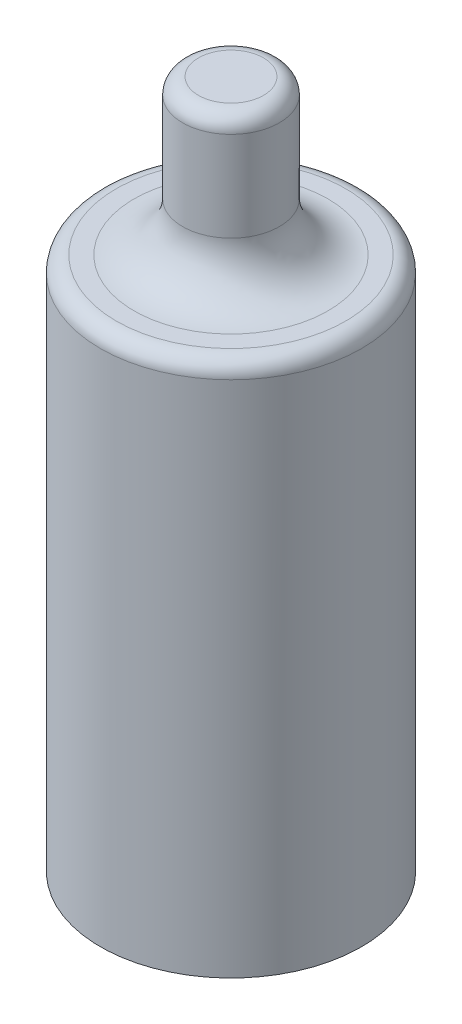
ISO-10303-21;
HEADER;
FILE_DESCRIPTION(('STEP AP214'),'2;1');
FILE_NAME('part.step','',(''),(''),'','','');
FILE_SCHEMA(('AUTOMOTIVE_DESIGN { 1 0 10303 214 1 1 1 1 }'));
ENDSEC;
DATA;
#1=APPLICATION_CONTEXT('core data for automotive mechanical design processes');
#2=APPLICATION_PROTOCOL_DEFINITION('international standard','automotive_design',2000,#1);
#3=PRODUCT_CONTEXT('',#1,'mechanical');
#4=PRODUCT('Part','Part','',(#3));
#5=PRODUCT_RELATED_PRODUCT_CATEGORY('part','',(#4));
#6=PRODUCT_DEFINITION_FORMATION('','',#4);
#7=PRODUCT_DEFINITION_CONTEXT('part definition',#1,'design');
#8=PRODUCT_DEFINITION('design','',#6,#7);
#9=PRODUCT_DEFINITION_SHAPE('','',#8);
#10=(LENGTH_UNIT() NAMED_UNIT(*) SI_UNIT(.MILLI.,.METRE.));
#11=(NAMED_UNIT(*) PLANE_ANGLE_UNIT() SI_UNIT($,.RADIAN.));
#12=(NAMED_UNIT(*) SI_UNIT($,.STERADIAN.) SOLID_ANGLE_UNIT());
#13=UNCERTAINTY_MEASURE_WITH_UNIT(LENGTH_MEASURE(1.E-05),#10,'distance_accuracy_value','');
#14=(GEOMETRIC_REPRESENTATION_CONTEXT(3) GLOBAL_UNCERTAINTY_ASSIGNED_CONTEXT((#13)) GLOBAL_UNIT_ASSIGNED_CONTEXT((#10,
#11,#12)) REPRESENTATION_CONTEXT('',''));
#15=CARTESIAN_POINT('',(0.,0.,0.));
#16=DIRECTION('',(0.,0.,1.));
#17=DIRECTION('',(1.,0.,0.));
#18=AXIS2_PLACEMENT_3D('',#15,#16,#17);
#19=CARTESIAN_POINT('',(0.,16.5354,0.));
#20=DIRECTION('',(0.,1.,0.));
#21=DIRECTION('',(0.,0.,1.));
#22=AXIS2_PLACEMENT_3D('',#19,#20,#21);
#23=PLANE('',#22);
#24=CARTESIAN_POINT('',(0.,16.5354,0.));
#25=DIRECTION('',(0.,-1.,0.));
#26=DIRECTION('',(0.,0.,-1.));
#27=AXIS2_PLACEMENT_3D('',#24,#25,#26);
#28=CIRCLE('',#27,0.781049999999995);
#29=CARTESIAN_POINT('',(0.,16.5354,-0.781049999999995));
#30=VERTEX_POINT('',#29);
#31=EDGE_CURVE('E109',#30,#30,#28,.T.);
#32=ORIENTED_EDGE('',*,*,#31,.F.);
#33=EDGE_LOOP('',(#32));
#34=FACE_BOUND('',#33,.T.);
#35=ADVANCED_FACE('F34',(#34),#23,.T.);
#36=CARTESIAN_POINT('',(0.,16.1544,0.));
#37=DIRECTION('',(0.,-1.,0.));
#38=DIRECTION('',(0.,0.,-1.));
#39=AXIS2_PLACEMENT_3D('',#36,#37,#38);
#40=TOROIDAL_SURFACE('',#39,0.78105,0.381);
#41=ORIENTED_EDGE('',*,*,#31,.T.);
#42=EDGE_LOOP('',(#41));
#43=FACE_BOUND('',#42,.T.);
#44=CARTESIAN_POINT('',(0.,16.1544,0.));
#45=DIRECTION('',(0.,-1.,0.));
#46=DIRECTION('',(0.,0.,-1.));
#47=AXIS2_PLACEMENT_3D('',#44,#45,#46);
#48=CIRCLE('',#47,1.16205);
#49=CARTESIAN_POINT('',(0.,16.1544,-1.16205));
#50=VERTEX_POINT('',#49);
#51=EDGE_CURVE('E106',#50,#50,#48,.T.);
#52=ORIENTED_EDGE('',*,*,#51,.F.);
#53=EDGE_LOOP('',(#52));
#54=FACE_BOUND('',#53,.T.);
#55=ADVANCED_FACE('F59',(#43,#54),#40,.T.);
#56=CARTESIAN_POINT('',(0.,0.,0.));
#57=DIRECTION('',(0.,-1.,0.));
#58=DIRECTION('',(0.,0.,-1.));
#59=AXIS2_PLACEMENT_3D('',#56,#57,#58);
#60=CYLINDRICAL_SURFACE('',#59,1.16205);
#61=ORIENTED_EDGE('',*,*,#51,.T.);
#62=EDGE_LOOP('',(#61));
#63=FACE_BOUND('',#62,.T.);
#64=CARTESIAN_POINT('',(0.,13.9954,0.));
#65=DIRECTION('',(0.,-1.,0.));
#66=DIRECTION('',(0.,0.,-1.));
#67=AXIS2_PLACEMENT_3D('',#64,#65,#66);
#68=CIRCLE('',#67,1.16205);
#69=CARTESIAN_POINT('',(0.,13.9954,-1.16205));
#70=VERTEX_POINT('',#69);
#71=EDGE_CURVE('E103',#70,#70,#68,.T.);
#72=ORIENTED_EDGE('',*,*,#71,.F.);
#73=EDGE_LOOP('',(#72));
#74=FACE_BOUND('',#73,.T.);
#75=ADVANCED_FACE('F64',(#63,#74),#60,.T.);
#76=CARTESIAN_POINT('',(0.,13.9954,0.));
#77=DIRECTION('',(0.,-1.,0.));
#78=DIRECTION('',(0.,0.,-1.));
#79=AXIS2_PLACEMENT_3D('',#76,#77,#78);
#80=TOROIDAL_SURFACE('',#79,2.33045,1.1684);
#81=ORIENTED_EDGE('',*,*,#71,.T.);
#82=EDGE_LOOP('',(#81));
#83=FACE_BOUND('',#82,.T.);
#84=CARTESIAN_POINT('',(0.,12.827,0.));
#85=DIRECTION('',(0.,-1.,0.));
#86=DIRECTION('',(0.,0.,-1.));
#87=AXIS2_PLACEMENT_3D('',#84,#85,#86);
#88=CIRCLE('',#87,2.33045000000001);
#89=CARTESIAN_POINT('',(0.,12.827,-2.33045000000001));
#90=VERTEX_POINT('',#89);
#91=EDGE_CURVE('E97',#90,#90,#88,.T.);
#92=ORIENTED_EDGE('',*,*,#91,.F.);
#93=EDGE_LOOP('',(#92));
#94=FACE_BOUND('',#93,.T.);
#95=ADVANCED_FACE('F71',(#83,#94),#80,.F.);
#96=CARTESIAN_POINT('',(2.33045000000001,12.827,0.));
#97=DIRECTION('',(0.,1.,0.));
#98=DIRECTION('',(0.,0.,1.));
#99=AXIS2_PLACEMENT_3D('',#96,#97,#98);
#100=PLANE('',#99);
#101=CARTESIAN_POINT('',(0.,12.827,0.));
#102=DIRECTION('',(0.,1.,0.));
#103=DIRECTION('',(0.,0.,1.));
#104=AXIS2_PLACEMENT_3D('',#101,#102,#103);
#105=CIRCLE('',#104,2.7559);
#106=CARTESIAN_POINT('',(0.,12.827,2.7559));
#107=VERTEX_POINT('',#106);
#108=EDGE_CURVE('E11',#107,#107,#105,.T.);
#109=ORIENTED_EDGE('',*,*,#108,.T.);
#110=EDGE_LOOP('',(#109));
#111=FACE_BOUND('',#110,.T.);
#112=ORIENTED_EDGE('',*,*,#91,.T.);
#113=EDGE_LOOP('',(#112));
#114=FACE_BOUND('',#113,.T.);
#115=ADVANCED_FACE('F75',(#111,#114),#100,.T.);
#116=CARTESIAN_POINT('',(0.,0.,0.));
#117=DIRECTION('',(0.,-1.,0.));
#118=DIRECTION('',(0.,0.,-1.));
#119=AXIS2_PLACEMENT_3D('',#116,#117,#118);
#120=CYLINDRICAL_SURFACE('',#119,3.1369);
#121=CARTESIAN_POINT('',(0.,12.446,0.));
#122=DIRECTION('',(0.,1.,0.));
#123=DIRECTION('',(0.,0.,1.));
#124=AXIS2_PLACEMENT_3D('',#121,#122,#123);
#125=CIRCLE('',#124,3.1369);
#126=CARTESIAN_POINT('',(0.,12.446,3.1369));
#127=VERTEX_POINT('',#126);
#128=EDGE_CURVE('E41',#127,#127,#125,.F.);
#129=ORIENTED_EDGE('',*,*,#128,.T.);
#130=EDGE_LOOP('',(#129));
#131=FACE_BOUND('',#130,.T.);
#132=CARTESIAN_POINT('',(0.,0.,0.));
#133=DIRECTION('',(0.,-1.,0.));
#134=DIRECTION('',(0.,0.,-1.));
#135=AXIS2_PLACEMENT_3D('',#132,#133,#134);
#136=CIRCLE('',#135,3.1369);
#137=CARTESIAN_POINT('',(0.,0.,-3.1369));
#138=VERTEX_POINT('',#137);
#139=EDGE_CURVE('E91',#138,#138,#136,.T.);
#140=ORIENTED_EDGE('',*,*,#139,.F.);
#141=EDGE_LOOP('',(#140));
#142=FACE_BOUND('',#141,.T.);
#143=ADVANCED_FACE('F79',(#131,#142),#120,.T.);
#144=CARTESIAN_POINT('',(3.1369,0.,0.));
#145=DIRECTION('',(0.,-1.,0.));
#146=DIRECTION('',(0.,0.,-1.));
#147=AXIS2_PLACEMENT_3D('',#144,#145,#146);
#148=PLANE('',#147);
#149=ORIENTED_EDGE('',*,*,#139,.T.);
#150=EDGE_LOOP('',(#149));
#151=FACE_BOUND('',#150,.T.);
#152=CARTESIAN_POINT('',(0.,0.,0.));
#153=DIRECTION('',(0.,-1.,0.));
#154=DIRECTION('',(0.,0.,-1.));
#155=AXIS2_PLACEMENT_3D('',#152,#153,#154);
#156=CIRCLE('',#155,2.4003);
#157=CARTESIAN_POINT('',(0.,0.,-2.4003));
#158=VERTEX_POINT('',#157);
#159=EDGE_CURVE('E94',#158,#158,#156,.T.);
#160=ORIENTED_EDGE('',*,*,#159,.F.);
#161=EDGE_LOOP('',(#160));
#162=FACE_BOUND('',#161,.T.);
#163=ADVANCED_FACE('F54',(#151,#162),#148,.T.);
#164=CARTESIAN_POINT('',(0.,0.,0.));
#165=DIRECTION('',(0.,-1.,0.));
#166=DIRECTION('',(0.,0.,-1.));
#167=AXIS2_PLACEMENT_3D('',#164,#165,#166);
#168=CYLINDRICAL_SURFACE('',#167,2.4003);
#169=ORIENTED_EDGE('',*,*,#159,.T.);
#170=EDGE_LOOP('',(#169));
#171=FACE_BOUND('',#170,.T.);
#172=CARTESIAN_POINT('',(0.,7.70175425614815,0.));
#173=DIRECTION('',(0.,-1.,0.));
#174=DIRECTION('',(0.,0.,-1.));
#175=AXIS2_PLACEMENT_3D('',#172,#173,#174);
#176=CIRCLE('',#175,2.4003);
#177=CARTESIAN_POINT('',(0.,7.70175425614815,-2.4003));
#178=VERTEX_POINT('',#177);
#179=EDGE_CURVE('E95',#178,#178,#176,.T.);
#180=ORIENTED_EDGE('',*,*,#179,.F.);
#181=EDGE_LOOP('',(#180));
#182=FACE_BOUND('',#181,.T.);
#183=ADVANCED_FACE('F46',(#171,#182),#168,.F.);
#184=CARTESIAN_POINT('',(0.,9.144,0.));
#185=DIRECTION('',(0.,-1.,0.));
#186=DIRECTION('',(0.,0.,-1.));
#187=AXIS2_PLACEMENT_3D('',#184,#185,#186);
#188=CONICAL_SURFACE('',#187,0.,1.02974425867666);
#189=ORIENTED_EDGE('',*,*,#179,.T.);
#190=EDGE_LOOP('',(#189));
#191=FACE_BOUND('',#190,.T.);
#192=CARTESIAN_POINT('',(0.,9.144,0.));
#193=VERTEX_POINT('',#192);
#194=VERTEX_LOOP('',#193);
#195=FACE_BOUND('',#194,.T.);
#196=ADVANCED_FACE('F44',(#191,#195),#188,.F.);
#197=CARTESIAN_POINT('',(0.,12.446,0.));
#198=DIRECTION('',(0.,1.,0.));
#199=DIRECTION('',(0.,0.,1.));
#200=AXIS2_PLACEMENT_3D('',#197,#198,#199);
#201=TOROIDAL_SURFACE('',#200,2.7559,0.381);
#202=ORIENTED_EDGE('',*,*,#108,.F.);
#203=EDGE_LOOP('',(#202));
#204=FACE_BOUND('',#203,.T.);
#205=ORIENTED_EDGE('',*,*,#128,.F.);
#206=EDGE_LOOP('',(#205));
#207=FACE_BOUND('',#206,.T.);
#208=ADVANCED_FACE('F36',(#204,#207),#201,.T.);
#209=CLOSED_SHELL('',(#35,#55,#75,#95,#115,#143,#163,#183,#196,#208));
#210=MANIFOLD_SOLID_BREP('B2',#209);
#211=ADVANCED_BREP_SHAPE_REPRESENTATION('',(#18,#210),#14);
#212=SHAPE_DEFINITION_REPRESENTATION(#9,#211);
ENDSEC;
END-ISO-10303-21;
